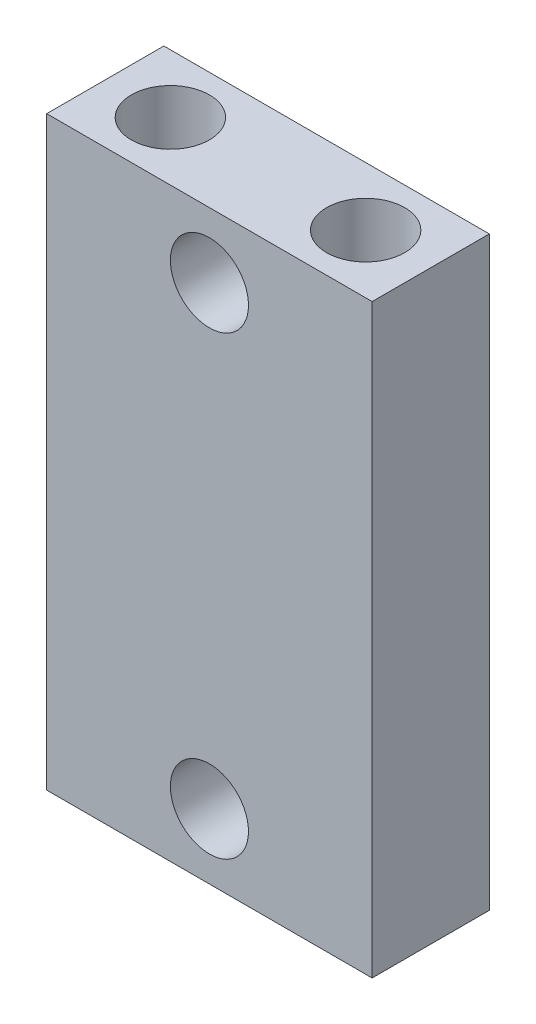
ISO-10303-21;
HEADER;
FILE_DESCRIPTION(('STEP AP214'),'2;1');
FILE_NAME('part.step','',(''),(''),'','','');
FILE_SCHEMA(('AUTOMOTIVE_DESIGN { 1 0 10303 214 1 1 1 1 }'));
ENDSEC;
DATA;
#1=APPLICATION_CONTEXT('core data for automotive mechanical design processes');
#2=APPLICATION_PROTOCOL_DEFINITION('international standard','automotive_design',2000,#1);
#3=PRODUCT_CONTEXT('',#1,'mechanical');
#4=PRODUCT('Part','Part','',(#3));
#5=PRODUCT_RELATED_PRODUCT_CATEGORY('part','',(#4));
#6=PRODUCT_DEFINITION_FORMATION('','',#4);
#7=PRODUCT_DEFINITION_CONTEXT('part definition',#1,'design');
#8=PRODUCT_DEFINITION('design','',#6,#7);
#9=PRODUCT_DEFINITION_SHAPE('','',#8);
#10=(LENGTH_UNIT() NAMED_UNIT(*) SI_UNIT(.MILLI.,.METRE.));
#11=(NAMED_UNIT(*) PLANE_ANGLE_UNIT() SI_UNIT($,.RADIAN.));
#12=(NAMED_UNIT(*) SI_UNIT($,.STERADIAN.) SOLID_ANGLE_UNIT());
#13=UNCERTAINTY_MEASURE_WITH_UNIT(LENGTH_MEASURE(1.E-05),#10,'distance_accuracy_value','');
#14=(GEOMETRIC_REPRESENTATION_CONTEXT(3) GLOBAL_UNCERTAINTY_ASSIGNED_CONTEXT((#13)) GLOBAL_UNIT_ASSIGNED_CONTEXT((#10,
#11,#12)) REPRESENTATION_CONTEXT('',''));
#15=CARTESIAN_POINT('',(0.,0.,0.));
#16=DIRECTION('',(0.,0.,1.));
#17=DIRECTION('',(1.,0.,0.));
#18=AXIS2_PLACEMENT_3D('',#15,#16,#17);
#19=CARTESIAN_POINT('',(0.,22.86,0.));
#20=DIRECTION('',(1.,0.,0.));
#21=DIRECTION('',(0.,0.,-1.));
#22=AXIS2_PLACEMENT_3D('',#19,#20,#21);
#23=PLANE('',#22);
#24=DIRECTION('',(0.,0.,1.));
#25=VECTOR('',#24,1.);
#26=CARTESIAN_POINT('',(0.,0.,0.));
#27=LINE('',#26,#25);
#28=CARTESIAN_POINT('',(0.,0.,-4.572));
#29=VERTEX_POINT('',#28);
#30=CARTESIAN_POINT('',(0.,0.,0.));
#31=VERTEX_POINT('',#30);
#32=EDGE_CURVE('E95',#29,#31,#27,.T.);
#33=ORIENTED_EDGE('',*,*,#32,.T.);
#34=DIRECTION('',(0.,-1.,0.));
#35=VECTOR('',#34,1.);
#36=CARTESIAN_POINT('',(0.,22.86,0.));
#37=LINE('',#36,#35);
#38=CARTESIAN_POINT('',(0.,22.86,0.));
#39=VERTEX_POINT('',#38);
#40=EDGE_CURVE('E11',#39,#31,#37,.T.);
#41=ORIENTED_EDGE('',*,*,#40,.F.);
#42=DIRECTION('',(0.,0.,1.));
#43=VECTOR('',#42,1.);
#44=CARTESIAN_POINT('',(0.,22.86,0.));
#45=LINE('',#44,#43);
#46=CARTESIAN_POINT('',(0.,22.86,-4.572));
#47=VERTEX_POINT('',#46);
#48=EDGE_CURVE('E83',#47,#39,#45,.T.);
#49=ORIENTED_EDGE('',*,*,#48,.F.);
#50=DIRECTION('',(0.,-1.,0.));
#51=VECTOR('',#50,1.);
#52=CARTESIAN_POINT('',(0.,22.86,-4.572));
#53=LINE('',#52,#51);
#54=EDGE_CURVE('E91',#47,#29,#53,.T.);
#55=ORIENTED_EDGE('',*,*,#54,.T.);
#56=EDGE_LOOP('',(#33,#41,#49,#55));
#57=FACE_BOUND('',#56,.T.);
#58=ADVANCED_FACE('F32',(#57),#23,.F.);
#59=CARTESIAN_POINT('',(0.,22.86,0.));
#60=DIRECTION('',(0.,0.,-1.));
#61=DIRECTION('',(-1.,0.,0.));
#62=AXIS2_PLACEMENT_3D('',#59,#60,#61);
#63=PLANE('',#62);
#64=CARTESIAN_POINT('',(6.35,2.54,0.));
#65=DIRECTION('',(0.,0.,1.));
#66=DIRECTION('',(1.,0.,0.));
#67=AXIS2_PLACEMENT_3D('',#64,#65,#66);
#68=CIRCLE('',#67,1.524);
#69=CARTESIAN_POINT('',(7.874,2.54,0.));
#70=VERTEX_POINT('',#69);
#71=EDGE_CURVE('E127',#70,#70,#68,.T.);
#72=ORIENTED_EDGE('',*,*,#71,.F.);
#73=EDGE_LOOP('',(#72));
#74=FACE_BOUND('',#73,.T.);
#75=CARTESIAN_POINT('',(6.35,20.32,0.));
#76=DIRECTION('',(0.,0.,1.));
#77=DIRECTION('',(1.,0.,0.));
#78=AXIS2_PLACEMENT_3D('',#75,#76,#77);
#79=CIRCLE('',#78,1.524);
#80=CARTESIAN_POINT('',(7.874,20.32,0.));
#81=VERTEX_POINT('',#80);
#82=EDGE_CURVE('E121',#81,#81,#79,.T.);
#83=ORIENTED_EDGE('',*,*,#82,.F.);
#84=EDGE_LOOP('',(#83));
#85=FACE_BOUND('',#84,.T.);
#86=DIRECTION('',(1.,0.,0.));
#87=VECTOR('',#86,1.);
#88=CARTESIAN_POINT('',(0.,0.,0.));
#89=LINE('',#88,#87);
#90=CARTESIAN_POINT('',(12.7,0.,0.));
#91=VERTEX_POINT('',#90);
#92=EDGE_CURVE('E87',#31,#91,#89,.T.);
#93=ORIENTED_EDGE('',*,*,#92,.T.);
#94=DIRECTION('',(0.,-1.,0.));
#95=VECTOR('',#94,1.);
#96=CARTESIAN_POINT('',(12.7,22.86,0.));
#97=LINE('',#96,#95);
#98=CARTESIAN_POINT('',(12.7,22.86,0.));
#99=VERTEX_POINT('',#98);
#100=EDGE_CURVE('E40',#99,#91,#97,.T.);
#101=ORIENTED_EDGE('',*,*,#100,.F.);
#102=DIRECTION('',(1.,0.,0.));
#103=VECTOR('',#102,1.);
#104=CARTESIAN_POINT('',(0.,22.86,0.));
#105=LINE('',#104,#103);
#106=EDGE_CURVE('E78',#39,#99,#105,.T.);
#107=ORIENTED_EDGE('',*,*,#106,.F.);
#108=ORIENTED_EDGE('',*,*,#40,.T.);
#109=EDGE_LOOP('',(#93,#101,#107,#108));
#110=FACE_BOUND('',#109,.T.);
#111=ADVANCED_FACE('F86',(#74,#85,#110),#63,.F.);
#112=CARTESIAN_POINT('',(12.7,22.86,0.));
#113=DIRECTION('',(-1.,0.,0.));
#114=DIRECTION('',(0.,0.,1.));
#115=AXIS2_PLACEMENT_3D('',#112,#113,#114);
#116=PLANE('',#115);
#117=DIRECTION('',(0.,0.,-1.));
#118=VECTOR('',#117,1.);
#119=CARTESIAN_POINT('',(12.7,0.,0.));
#120=LINE('',#119,#118);
#121=CARTESIAN_POINT('',(12.7,0.,-4.572));
#122=VERTEX_POINT('',#121);
#123=EDGE_CURVE('E65',#91,#122,#120,.T.);
#124=ORIENTED_EDGE('',*,*,#123,.T.);
#125=DIRECTION('',(0.,-1.,0.));
#126=VECTOR('',#125,1.);
#127=CARTESIAN_POINT('',(12.7,22.86,-4.572));
#128=LINE('',#127,#126);
#129=CARTESIAN_POINT('',(12.7,22.86,-4.572));
#130=VERTEX_POINT('',#129);
#131=EDGE_CURVE('E88',#130,#122,#128,.T.);
#132=ORIENTED_EDGE('',*,*,#131,.F.);
#133=DIRECTION('',(0.,0.,-1.));
#134=VECTOR('',#133,1.);
#135=CARTESIAN_POINT('',(12.7,22.86,0.));
#136=LINE('',#135,#134);
#137=EDGE_CURVE('E81',#99,#130,#136,.T.);
#138=ORIENTED_EDGE('',*,*,#137,.F.);
#139=ORIENTED_EDGE('',*,*,#100,.T.);
#140=EDGE_LOOP('',(#124,#132,#138,#139));
#141=FACE_BOUND('',#140,.T.);
#142=ADVANCED_FACE('F89',(#141),#116,.F.);
#143=CARTESIAN_POINT('',(0.,22.86,-4.572));
#144=DIRECTION('',(0.,0.,1.));
#145=DIRECTION('',(1.,0.,0.));
#146=AXIS2_PLACEMENT_3D('',#143,#144,#145);
#147=PLANE('',#146);
#148=CARTESIAN_POINT('',(6.35,2.54,-4.572));
#149=DIRECTION('',(0.,0.,1.));
#150=DIRECTION('',(1.,0.,0.));
#151=AXIS2_PLACEMENT_3D('',#148,#149,#150);
#152=CIRCLE('',#151,1.524);
#153=CARTESIAN_POINT('',(7.874,2.54,-4.572));
#154=VERTEX_POINT('',#153);
#155=EDGE_CURVE('E124',#154,#154,#152,.T.);
#156=ORIENTED_EDGE('',*,*,#155,.T.);
#157=EDGE_LOOP('',(#156));
#158=FACE_BOUND('',#157,.T.);
#159=CARTESIAN_POINT('',(6.35,20.32,-4.572));
#160=DIRECTION('',(0.,0.,1.));
#161=DIRECTION('',(1.,0.,0.));
#162=AXIS2_PLACEMENT_3D('',#159,#160,#161);
#163=CIRCLE('',#162,1.524);
#164=CARTESIAN_POINT('',(7.874,20.32,-4.572));
#165=VERTEX_POINT('',#164);
#166=EDGE_CURVE('E118',#165,#165,#163,.T.);
#167=ORIENTED_EDGE('',*,*,#166,.T.);
#168=EDGE_LOOP('',(#167));
#169=FACE_BOUND('',#168,.T.);
#170=DIRECTION('',(-1.,0.,0.));
#171=VECTOR('',#170,1.);
#172=CARTESIAN_POINT('',(0.,0.,-4.572));
#173=LINE('',#172,#171);
#174=EDGE_CURVE('E71',#122,#29,#173,.T.);
#175=ORIENTED_EDGE('',*,*,#174,.T.);
#176=ORIENTED_EDGE('',*,*,#54,.F.);
#177=DIRECTION('',(-1.,0.,0.));
#178=VECTOR('',#177,1.);
#179=CARTESIAN_POINT('',(0.,22.86,-4.572));
#180=LINE('',#179,#178);
#181=EDGE_CURVE('E48',#130,#47,#180,.T.);
#182=ORIENTED_EDGE('',*,*,#181,.F.);
#183=ORIENTED_EDGE('',*,*,#131,.T.);
#184=EDGE_LOOP('',(#175,#176,#182,#183));
#185=FACE_BOUND('',#184,.T.);
#186=ADVANCED_FACE('F103',(#158,#169,#185),#147,.F.);
#187=CARTESIAN_POINT('',(0.,22.86,0.));
#188=DIRECTION('',(0.,-1.,0.));
#189=DIRECTION('',(0.,0.,-1.));
#190=AXIS2_PLACEMENT_3D('',#187,#188,#189);
#191=PLANE('',#190);
#192=CARTESIAN_POINT('',(10.16,22.86,-2.286));
#193=DIRECTION('',(0.,1.,0.));
#194=DIRECTION('',(0.,0.,1.));
#195=AXIS2_PLACEMENT_3D('',#192,#193,#194);
#196=CIRCLE('',#195,1.524);
#197=CARTESIAN_POINT('',(10.16,22.86,-0.762000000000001));
#198=VERTEX_POINT('',#197);
#199=EDGE_CURVE('E115',#198,#198,#196,.T.);
#200=ORIENTED_EDGE('',*,*,#199,.F.);
#201=EDGE_LOOP('',(#200));
#202=FACE_BOUND('',#201,.T.);
#203=CARTESIAN_POINT('',(2.54,22.86,-2.286));
#204=DIRECTION('',(0.,1.,0.));
#205=DIRECTION('',(0.,0.,1.));
#206=AXIS2_PLACEMENT_3D('',#203,#204,#205);
#207=CIRCLE('',#206,1.524);
#208=CARTESIAN_POINT('',(2.54,22.86,-0.762));
#209=VERTEX_POINT('',#208);
#210=EDGE_CURVE('E109',#209,#209,#207,.T.);
#211=ORIENTED_EDGE('',*,*,#210,.F.);
#212=EDGE_LOOP('',(#211));
#213=FACE_BOUND('',#212,.T.);
#214=ORIENTED_EDGE('',*,*,#48,.T.);
#215=ORIENTED_EDGE('',*,*,#106,.T.);
#216=ORIENTED_EDGE('',*,*,#137,.T.);
#217=ORIENTED_EDGE('',*,*,#181,.T.);
#218=EDGE_LOOP('',(#214,#215,#216,#217));
#219=FACE_BOUND('',#218,.T.);
#220=ADVANCED_FACE('F79',(#202,#213,#219),#191,.F.);
#221=CARTESIAN_POINT('',(0.,0.,0.));
#222=DIRECTION('',(0.,-1.,0.));
#223=DIRECTION('',(0.,0.,-1.));
#224=AXIS2_PLACEMENT_3D('',#221,#222,#223);
#225=PLANE('',#224);
#226=ORIENTED_EDGE('',*,*,#32,.F.);
#227=ORIENTED_EDGE('',*,*,#174,.F.);
#228=ORIENTED_EDGE('',*,*,#123,.F.);
#229=ORIENTED_EDGE('',*,*,#92,.F.);
#230=EDGE_LOOP('',(#226,#227,#228,#229));
#231=FACE_BOUND('',#230,.T.);
#232=ADVANCED_FACE('F106',(#231),#225,.T.);
#233=CARTESIAN_POINT('',(2.54,15.24,-2.286));
#234=DIRECTION('',(0.,1.,0.));
#235=DIRECTION('',(0.,0.,1.));
#236=AXIS2_PLACEMENT_3D('',#233,#234,#235);
#237=CYLINDRICAL_SURFACE('',#236,1.524);
#238=CARTESIAN_POINT('',(2.54,15.24,-2.286));
#239=DIRECTION('',(0.,1.,0.));
#240=DIRECTION('',(0.,0.,1.));
#241=AXIS2_PLACEMENT_3D('',#238,#239,#240);
#242=CIRCLE('',#241,1.524);
#243=CARTESIAN_POINT('',(2.54,15.24,-0.762));
#244=VERTEX_POINT('',#243);
#245=EDGE_CURVE('E98',#244,#244,#242,.T.);
#246=CARTESIAN_POINT('',(2.54,15.24,-0.762));
#247=CARTESIAN_POINT('',(2.54,15.319375,-0.762));
#248=CARTESIAN_POINT('',(2.54,15.39875,-0.762));
#249=CARTESIAN_POINT('',(2.54,15.5575,-0.762));
#250=CARTESIAN_POINT('',(2.54,15.636875,-0.762));
#251=CARTESIAN_POINT('',(2.54,15.795625,-0.762));
#252=CARTESIAN_POINT('',(2.54,15.875,-0.762));
#253=CARTESIAN_POINT('',(2.54,16.03375,-0.762));
#254=CARTESIAN_POINT('',(2.54,16.113125,-0.762));
#255=CARTESIAN_POINT('',(2.54,16.271875,-0.762));
#256=CARTESIAN_POINT('',(2.54,16.35125,-0.762));
#257=CARTESIAN_POINT('',(2.54,16.51,-0.762));
#258=CARTESIAN_POINT('',(2.54,16.589375,-0.762));
#259=CARTESIAN_POINT('',(2.54,16.748125,-0.762));
#260=CARTESIAN_POINT('',(2.54,16.8275,-0.762));
#261=CARTESIAN_POINT('',(2.54,16.98625,-0.762));
#262=CARTESIAN_POINT('',(2.54,17.065625,-0.762));
#263=CARTESIAN_POINT('',(2.54,17.224375,-0.762));
#264=CARTESIAN_POINT('',(2.54,17.30375,-0.762));
#265=CARTESIAN_POINT('',(2.54,17.4625,-0.762));
#266=CARTESIAN_POINT('',(2.54,17.541875,-0.762));
#267=CARTESIAN_POINT('',(2.54,17.700625,-0.762));
#268=CARTESIAN_POINT('',(2.54,17.78,-0.762));
#269=CARTESIAN_POINT('',(2.54,17.93875,-0.762));
#270=CARTESIAN_POINT('',(2.54,18.018125,-0.762));
#271=CARTESIAN_POINT('',(2.54,18.176875,-0.762));
#272=CARTESIAN_POINT('',(2.54,18.25625,-0.762));
#273=CARTESIAN_POINT('',(2.54,18.415,-0.762));
#274=CARTESIAN_POINT('',(2.54,18.494375,-0.762));
#275=CARTESIAN_POINT('',(2.54,18.653125,-0.762));
#276=CARTESIAN_POINT('',(2.54,18.7325,-0.762));
#277=CARTESIAN_POINT('',(2.54,18.89125,-0.762));
#278=CARTESIAN_POINT('',(2.54,18.970625,-0.762));
#279=CARTESIAN_POINT('',(2.54,19.129375,-0.762));
#280=CARTESIAN_POINT('',(2.54,19.20875,-0.762));
#281=CARTESIAN_POINT('',(2.54,19.3675,-0.762));
#282=CARTESIAN_POINT('',(2.54,19.446875,-0.762));
#283=CARTESIAN_POINT('',(2.54,19.605625,-0.762));
#284=CARTESIAN_POINT('',(2.54,19.685,-0.762));
#285=CARTESIAN_POINT('',(2.54,19.84375,-0.762));
#286=CARTESIAN_POINT('',(2.54,19.923125,-0.762));
#287=CARTESIAN_POINT('',(2.54,20.081875,-0.762));
#288=CARTESIAN_POINT('',(2.54,20.16125,-0.762));
#289=CARTESIAN_POINT('',(2.54,20.32,-0.762));
#290=CARTESIAN_POINT('',(2.54,20.399375,-0.762));
#291=CARTESIAN_POINT('',(2.54,20.558125,-0.762));
#292=CARTESIAN_POINT('',(2.54,20.6375,-0.762));
#293=CARTESIAN_POINT('',(2.54,20.79625,-0.762));
#294=CARTESIAN_POINT('',(2.54,20.875625,-0.762));
#295=CARTESIAN_POINT('',(2.54,21.034375,-0.762));
#296=CARTESIAN_POINT('',(2.54,21.11375,-0.762));
#297=CARTESIAN_POINT('',(2.54,21.2725,-0.762));
#298=CARTESIAN_POINT('',(2.54,21.351875,-0.762));
#299=CARTESIAN_POINT('',(2.54,21.510625,-0.762));
#300=CARTESIAN_POINT('',(2.54,21.59,-0.762));
#301=CARTESIAN_POINT('',(2.54,21.74875,-0.762));
#302=CARTESIAN_POINT('',(2.54,21.828125,-0.762));
#303=CARTESIAN_POINT('',(2.54,21.986875,-0.762));
#304=CARTESIAN_POINT('',(2.54,22.06625,-0.762));
#305=CARTESIAN_POINT('',(2.54,22.225,-0.762));
#306=CARTESIAN_POINT('',(2.54,22.304375,-0.762));
#307=CARTESIAN_POINT('',(2.54,22.463125,-0.762));
#308=CARTESIAN_POINT('',(2.54,22.5425,-0.762));
#309=CARTESIAN_POINT('',(2.54,22.70125,-0.762));
#310=CARTESIAN_POINT('',(2.54,22.780625,-0.762));
#311=CARTESIAN_POINT('',(2.54,22.86,-0.762));
#312=B_SPLINE_CURVE_WITH_KNOTS('',3,(#246,#247,#248,#249,#250,#251,#252,#253,#254,#255,#256,
#257,#258,#259,#260,#261,#262,#263,#264,#265,#266,#267,#268,#269,#270,#271,#272,#273,#274,#275,
#276,#277,#278,#279,#280,#281,#282,#283,#284,#285,#286,#287,#288,#289,#290,#291,#292,#293,#294,
#295,#296,#297,#298,#299,#300,#301,#302,#303,#304,#305,#306,#307,#308,#309,#310,#311),
.UNSPECIFIED.,.F.,.F.,(4,2,2,2,2,2,2,2,2,2,2,2,2,2,2,2,2,2,2,2,2,2,2,2,2,2,2,2,2,2,2,2,4),(0.,
0.238125,0.476249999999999,0.714375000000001,0.9525,1.190625,1.42875,1.666875,1.905,2.143125,
2.38125,2.619375,2.8575,3.095625,3.33375,3.571875,3.81,4.048125,4.28625,4.524375,4.7625,
5.000625,5.23875,5.476875,5.715,5.953125,6.19125,6.429375,6.6675,6.905625,7.14375,7.381875,
7.62),.UNSPECIFIED.);
#313=EDGE_CURVE('BSEAM191',#244,#209,#312,.T.);
#314=ORIENTED_EDGE('',*,*,#245,.F.);
#315=ORIENTED_EDGE('',*,*,#210,.T.);
#316=ORIENTED_EDGE('',*,*,#313,.T.);
#317=ORIENTED_EDGE('',*,*,#313,.F.);
#318=EDGE_LOOP('',(#314,#316,#315,#317));
#319=FACE_BOUND('',#318,.T.);
#320=ADVANCED_FACE('F191',(#319),#237,.F.);
#321=CARTESIAN_POINT('',(2.54,15.24,-2.286));
#322=DIRECTION('',(0.,1.,0.));
#323=DIRECTION('',(0.,0.,1.));
#324=AXIS2_PLACEMENT_3D('',#321,#322,#323);
#325=PLANE('',#324);
#326=ORIENTED_EDGE('',*,*,#245,.T.);
#327=EDGE_LOOP('',(#326));
#328=FACE_BOUND('',#327,.T.);
#329=ADVANCED_FACE('F197',(#328),#325,.T.);
#330=CARTESIAN_POINT('',(10.16,15.24,-2.286));
#331=DIRECTION('',(0.,1.,0.));
#332=DIRECTION('',(0.,0.,1.));
#333=AXIS2_PLACEMENT_3D('',#330,#331,#332);
#334=CYLINDRICAL_SURFACE('',#333,1.524);
#335=CARTESIAN_POINT('',(10.16,15.24,-2.286));
#336=DIRECTION('',(0.,1.,0.));
#337=DIRECTION('',(0.,0.,1.));
#338=AXIS2_PLACEMENT_3D('',#335,#336,#337);
#339=CIRCLE('',#338,1.524);
#340=CARTESIAN_POINT('',(10.16,15.24,-0.762000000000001));
#341=VERTEX_POINT('',#340);
#342=EDGE_CURVE('E112',#341,#341,#339,.T.);
#343=CARTESIAN_POINT('',(10.16,15.24,-0.762000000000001));
#344=CARTESIAN_POINT('',(10.16,15.319375,-0.762000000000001));
#345=CARTESIAN_POINT('',(10.16,15.39875,-0.762000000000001));
#346=CARTESIAN_POINT('',(10.16,15.5575,-0.762000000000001));
#347=CARTESIAN_POINT('',(10.16,15.636875,-0.762000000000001));
#348=CARTESIAN_POINT('',(10.16,15.795625,-0.762000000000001));
#349=CARTESIAN_POINT('',(10.16,15.875,-0.762000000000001));
#350=CARTESIAN_POINT('',(10.16,16.03375,-0.762000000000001));
#351=CARTESIAN_POINT('',(10.16,16.113125,-0.762000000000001));
#352=CARTESIAN_POINT('',(10.16,16.271875,-0.762000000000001));
#353=CARTESIAN_POINT('',(10.16,16.35125,-0.762000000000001));
#354=CARTESIAN_POINT('',(10.16,16.51,-0.762000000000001));
#355=CARTESIAN_POINT('',(10.16,16.589375,-0.762000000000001));
#356=CARTESIAN_POINT('',(10.16,16.748125,-0.762000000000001));
#357=CARTESIAN_POINT('',(10.16,16.8275,-0.762000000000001));
#358=CARTESIAN_POINT('',(10.16,16.98625,-0.762000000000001));
#359=CARTESIAN_POINT('',(10.16,17.065625,-0.762000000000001));
#360=CARTESIAN_POINT('',(10.16,17.224375,-0.762000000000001));
#361=CARTESIAN_POINT('',(10.16,17.30375,-0.762000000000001));
#362=CARTESIAN_POINT('',(10.16,17.4625,-0.762000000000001));
#363=CARTESIAN_POINT('',(10.16,17.541875,-0.762000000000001));
#364=CARTESIAN_POINT('',(10.16,17.700625,-0.762000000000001));
#365=CARTESIAN_POINT('',(10.16,17.78,-0.762000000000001));
#366=CARTESIAN_POINT('',(10.16,17.93875,-0.762000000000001));
#367=CARTESIAN_POINT('',(10.16,18.018125,-0.762000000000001));
#368=CARTESIAN_POINT('',(10.16,18.176875,-0.762000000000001));
#369=CARTESIAN_POINT('',(10.16,18.25625,-0.762000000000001));
#370=CARTESIAN_POINT('',(10.16,18.415,-0.762000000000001));
#371=CARTESIAN_POINT('',(10.16,18.494375,-0.762000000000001));
#372=CARTESIAN_POINT('',(10.16,18.653125,-0.762000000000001));
#373=CARTESIAN_POINT('',(10.16,18.7325,-0.762000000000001));
#374=CARTESIAN_POINT('',(10.16,18.89125,-0.762000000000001));
#375=CARTESIAN_POINT('',(10.16,18.970625,-0.762000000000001));
#376=CARTESIAN_POINT('',(10.16,19.129375,-0.762000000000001));
#377=CARTESIAN_POINT('',(10.16,19.20875,-0.762000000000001));
#378=CARTESIAN_POINT('',(10.16,19.3675,-0.762000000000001));
#379=CARTESIAN_POINT('',(10.16,19.446875,-0.762000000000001));
#380=CARTESIAN_POINT('',(10.16,19.605625,-0.762000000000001));
#381=CARTESIAN_POINT('',(10.16,19.685,-0.762000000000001));
#382=CARTESIAN_POINT('',(10.16,19.84375,-0.762000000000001));
#383=CARTESIAN_POINT('',(10.16,19.923125,-0.762000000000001));
#384=CARTESIAN_POINT('',(10.16,20.081875,-0.762000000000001));
#385=CARTESIAN_POINT('',(10.16,20.16125,-0.762000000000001));
#386=CARTESIAN_POINT('',(10.16,20.32,-0.762000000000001));
#387=CARTESIAN_POINT('',(10.16,20.399375,-0.762000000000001));
#388=CARTESIAN_POINT('',(10.16,20.558125,-0.762000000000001));
#389=CARTESIAN_POINT('',(10.16,20.6375,-0.762000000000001));
#390=CARTESIAN_POINT('',(10.16,20.79625,-0.762000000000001));
#391=CARTESIAN_POINT('',(10.16,20.875625,-0.762000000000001));
#392=CARTESIAN_POINT('',(10.16,21.034375,-0.762000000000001));
#393=CARTESIAN_POINT('',(10.16,21.11375,-0.762000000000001));
#394=CARTESIAN_POINT('',(10.16,21.2725,-0.762000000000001));
#395=CARTESIAN_POINT('',(10.16,21.351875,-0.762000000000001));
#396=CARTESIAN_POINT('',(10.16,21.510625,-0.762000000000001));
#397=CARTESIAN_POINT('',(10.16,21.59,-0.762000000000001));
#398=CARTESIAN_POINT('',(10.16,21.74875,-0.762000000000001));
#399=CARTESIAN_POINT('',(10.16,21.828125,-0.762000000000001));
#400=CARTESIAN_POINT('',(10.16,21.986875,-0.762000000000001));
#401=CARTESIAN_POINT('',(10.16,22.06625,-0.762000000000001));
#402=CARTESIAN_POINT('',(10.16,22.225,-0.762000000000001));
#403=CARTESIAN_POINT('',(10.16,22.304375,-0.762000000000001));
#404=CARTESIAN_POINT('',(10.16,22.463125,-0.762000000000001));
#405=CARTESIAN_POINT('',(10.16,22.5425,-0.762000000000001));
#406=CARTESIAN_POINT('',(10.16,22.70125,-0.762000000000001));
#407=CARTESIAN_POINT('',(10.16,22.780625,-0.762000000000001));
#408=CARTESIAN_POINT('',(10.16,22.86,-0.762000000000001));
#409=B_SPLINE_CURVE_WITH_KNOTS('',3,(#343,#344,#345,#346,#347,#348,#349,#350,#351,#352,#353,
#354,#355,#356,#357,#358,#359,#360,#361,#362,#363,#364,#365,#366,#367,#368,#369,#370,#371,#372,
#373,#374,#375,#376,#377,#378,#379,#380,#381,#382,#383,#384,#385,#386,#387,#388,#389,#390,#391,
#392,#393,#394,#395,#396,#397,#398,#399,#400,#401,#402,#403,#404,#405,#406,#407,#408),
.UNSPECIFIED.,.F.,.F.,(4,2,2,2,2,2,2,2,2,2,2,2,2,2,2,2,2,2,2,2,2,2,2,2,2,2,2,2,2,2,2,2,4),(0.,
0.238125,0.476249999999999,0.714375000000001,0.9525,1.190625,1.42875,1.666875,1.905,2.143125,
2.38125,2.619375,2.8575,3.095625,3.33375,3.571875,3.81,4.048125,4.28625,4.524375,4.7625,
5.000625,5.23875,5.476875,5.715,5.953125,6.19125,6.429375,6.6675,6.905625,7.14375,7.381875,
7.62),.UNSPECIFIED.);
#410=EDGE_CURVE('BSEAM153',#341,#198,#409,.T.);
#411=ORIENTED_EDGE('',*,*,#342,.F.);
#412=ORIENTED_EDGE('',*,*,#199,.T.);
#413=ORIENTED_EDGE('',*,*,#410,.T.);
#414=ORIENTED_EDGE('',*,*,#410,.F.);
#415=EDGE_LOOP('',(#411,#413,#412,#414));
#416=FACE_BOUND('',#415,.T.);
#417=ADVANCED_FACE('F153',(#416),#334,.F.);
#418=CARTESIAN_POINT('',(10.16,15.24,-2.286));
#419=DIRECTION('',(0.,1.,0.));
#420=DIRECTION('',(0.,0.,1.));
#421=AXIS2_PLACEMENT_3D('',#418,#419,#420);
#422=PLANE('',#421);
#423=ORIENTED_EDGE('',*,*,#342,.T.);
#424=EDGE_LOOP('',(#423));
#425=FACE_BOUND('',#424,.T.);
#426=ADVANCED_FACE('F147',(#425),#422,.T.);
#427=CARTESIAN_POINT('',(6.35,20.32,-4.572));
#428=DIRECTION('',(0.,0.,1.));
#429=DIRECTION('',(1.,0.,0.));
#430=AXIS2_PLACEMENT_3D('',#427,#428,#429);
#431=CYLINDRICAL_SURFACE('',#430,1.524);
#432=ORIENTED_EDGE('',*,*,#166,.F.);
#433=EDGE_LOOP('',(#432));
#434=FACE_BOUND('',#433,.T.);
#435=ORIENTED_EDGE('',*,*,#82,.T.);
#436=EDGE_LOOP('',(#435));
#437=FACE_BOUND('',#436,.T.);
#438=ADVANCED_FACE('F138',(#434,#437),#431,.F.);
#439=CARTESIAN_POINT('',(6.35,2.54,-4.572));
#440=DIRECTION('',(0.,0.,1.));
#441=DIRECTION('',(1.,0.,0.));
#442=AXIS2_PLACEMENT_3D('',#439,#440,#441);
#443=CYLINDRICAL_SURFACE('',#442,1.524);
#444=ORIENTED_EDGE('',*,*,#155,.F.);
#445=EDGE_LOOP('',(#444));
#446=FACE_BOUND('',#445,.T.);
#447=ORIENTED_EDGE('',*,*,#71,.T.);
#448=EDGE_LOOP('',(#447));
#449=FACE_BOUND('',#448,.T.);
#450=ADVANCED_FACE('F135',(#446,#449),#443,.F.);
#451=CLOSED_SHELL('',(#58,#111,#142,#186,#220,#232,#320,#329,#417,#426,#438,#450));
#452=MANIFOLD_SOLID_BREP('B2',#451);
#453=ADVANCED_BREP_SHAPE_REPRESENTATION('',(#18,#452),#14);
#454=SHAPE_DEFINITION_REPRESENTATION(#9,#453);
ENDSEC;
END-ISO-10303-21;
